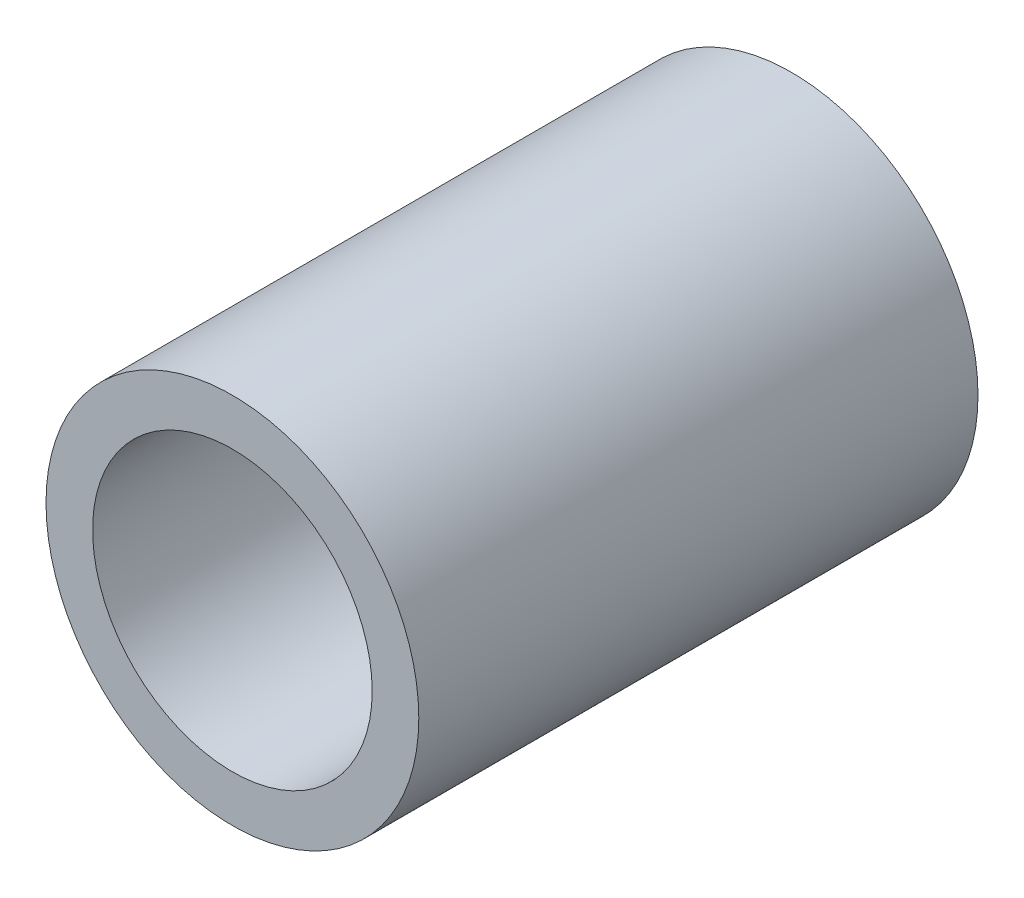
ISO-10303-21;
HEADER;
FILE_DESCRIPTION(('STEP AP214'),'2;1');
FILE_NAME('part.step','',(''),(''),'','','');
FILE_SCHEMA(('AUTOMOTIVE_DESIGN { 1 0 10303 214 1 1 1 1 }'));
ENDSEC;
DATA;
#1=APPLICATION_CONTEXT('core data for automotive mechanical design processes');
#2=APPLICATION_PROTOCOL_DEFINITION('international standard','automotive_design',2000,#1);
#3=PRODUCT_CONTEXT('',#1,'mechanical');
#4=PRODUCT('Part','Part','',(#3));
#5=PRODUCT_RELATED_PRODUCT_CATEGORY('part','',(#4));
#6=PRODUCT_DEFINITION_FORMATION('','',#4);
#7=PRODUCT_DEFINITION_CONTEXT('part definition',#1,'design');
#8=PRODUCT_DEFINITION('design','',#6,#7);
#9=PRODUCT_DEFINITION_SHAPE('','',#8);
#10=(LENGTH_UNIT() NAMED_UNIT(*) SI_UNIT(.MILLI.,.METRE.));
#11=(NAMED_UNIT(*) PLANE_ANGLE_UNIT() SI_UNIT($,.RADIAN.));
#12=(NAMED_UNIT(*) SI_UNIT($,.STERADIAN.) SOLID_ANGLE_UNIT());
#13=UNCERTAINTY_MEASURE_WITH_UNIT(LENGTH_MEASURE(1.E-05),#10,'distance_accuracy_value','');
#14=(GEOMETRIC_REPRESENTATION_CONTEXT(3) GLOBAL_UNCERTAINTY_ASSIGNED_CONTEXT((#13)) GLOBAL_UNIT_ASSIGNED_CONTEXT((#10,
#11,#12)) REPRESENTATION_CONTEXT('',''));
#15=CARTESIAN_POINT('',(0.,0.,0.));
#16=DIRECTION('',(0.,0.,1.));
#17=DIRECTION('',(1.,0.,0.));
#18=AXIS2_PLACEMENT_3D('',#15,#16,#17);
#19=CARTESIAN_POINT('',(0.,0.,18.));
#20=DIRECTION('',(0.,0.,1.));
#21=DIRECTION('',(1.,0.,0.));
#22=AXIS2_PLACEMENT_3D('',#19,#20,#21);
#23=PLANE('',#22);
#24=CARTESIAN_POINT('',(0.,0.,18.));
#25=DIRECTION('',(0.,0.,1.));
#26=DIRECTION('',(1.,0.,0.));
#27=AXIS2_PLACEMENT_3D('',#24,#25,#26);
#28=CIRCLE('',#27,6.);
#29=CARTESIAN_POINT('',(6.,0.,18.));
#30=VERTEX_POINT('',#29);
#31=EDGE_CURVE('E10',#30,#30,#28,.T.);
#32=ORIENTED_EDGE('',*,*,#31,.T.);
#33=EDGE_LOOP('',(#32));
#34=FACE_BOUND('',#33,.T.);
#35=CARTESIAN_POINT('',(0.,0.,18.));
#36=DIRECTION('',(0.,0.,1.));
#37=DIRECTION('',(1.,0.,0.));
#38=AXIS2_PLACEMENT_3D('',#35,#36,#37);
#39=CIRCLE('',#38,4.5);
#40=CARTESIAN_POINT('',(4.5,0.,18.));
#41=VERTEX_POINT('',#40);
#42=EDGE_CURVE('E43',#41,#41,#39,.T.);
#43=ORIENTED_EDGE('',*,*,#42,.F.);
#44=EDGE_LOOP('',(#43));
#45=FACE_BOUND('',#44,.T.);
#46=ADVANCED_FACE('F32',(#34,#45),#23,.T.);
#47=CARTESIAN_POINT('',(0.,0.,0.));
#48=DIRECTION('',(0.,0.,1.));
#49=DIRECTION('',(1.,0.,0.));
#50=AXIS2_PLACEMENT_3D('',#47,#48,#49);
#51=PLANE('',#50);
#52=CARTESIAN_POINT('',(0.,0.,0.));
#53=DIRECTION('',(0.,0.,1.));
#54=DIRECTION('',(1.,0.,0.));
#55=AXIS2_PLACEMENT_3D('',#52,#53,#54);
#56=CIRCLE('',#55,6.);
#57=CARTESIAN_POINT('',(6.,0.,0.));
#58=VERTEX_POINT('',#57);
#59=EDGE_CURVE('E36',#58,#58,#56,.T.);
#60=ORIENTED_EDGE('',*,*,#59,.F.);
#61=EDGE_LOOP('',(#60));
#62=FACE_BOUND('',#61,.T.);
#63=CARTESIAN_POINT('',(0.,0.,0.));
#64=DIRECTION('',(0.,0.,1.));
#65=DIRECTION('',(1.,0.,0.));
#66=AXIS2_PLACEMENT_3D('',#63,#64,#65);
#67=CIRCLE('',#66,4.5);
#68=CARTESIAN_POINT('',(4.5,0.,0.));
#69=VERTEX_POINT('',#68);
#70=EDGE_CURVE('E45',#69,#69,#67,.T.);
#71=ORIENTED_EDGE('',*,*,#70,.T.);
#72=EDGE_LOOP('',(#71));
#73=FACE_BOUND('',#72,.T.);
#74=ADVANCED_FACE('F55',(#62,#73),#51,.F.);
#75=CARTESIAN_POINT('',(0.,0.,18.));
#76=DIRECTION('',(0.,0.,-1.));
#77=DIRECTION('',(-1.,0.,0.));
#78=AXIS2_PLACEMENT_3D('',#75,#76,#77);
#79=CYLINDRICAL_SURFACE('',#78,6.);
#80=ORIENTED_EDGE('',*,*,#31,.F.);
#81=EDGE_LOOP('',(#80));
#82=FACE_BOUND('',#81,.T.);
#83=ORIENTED_EDGE('',*,*,#59,.T.);
#84=EDGE_LOOP('',(#83));
#85=FACE_BOUND('',#84,.T.);
#86=ADVANCED_FACE('F34',(#82,#85),#79,.T.);
#87=CARTESIAN_POINT('',(0.,0.,18.));
#88=DIRECTION('',(0.,0.,-1.));
#89=DIRECTION('',(-1.,0.,0.));
#90=AXIS2_PLACEMENT_3D('',#87,#88,#89);
#91=CYLINDRICAL_SURFACE('',#90,4.5);
#92=ORIENTED_EDGE('',*,*,#42,.T.);
#93=EDGE_LOOP('',(#92));
#94=FACE_BOUND('',#93,.T.);
#95=ORIENTED_EDGE('',*,*,#70,.F.);
#96=EDGE_LOOP('',(#95));
#97=FACE_BOUND('',#96,.T.);
#98=ADVANCED_FACE('F51',(#94,#97),#91,.F.);
#99=CLOSED_SHELL('',(#46,#74,#86,#98));
#100=MANIFOLD_SOLID_BREP('B2',#99);
#101=ADVANCED_BREP_SHAPE_REPRESENTATION('',(#18,#100),#14);
#102=SHAPE_DEFINITION_REPRESENTATION(#9,#101);
ENDSEC;
END-ISO-10303-21;
